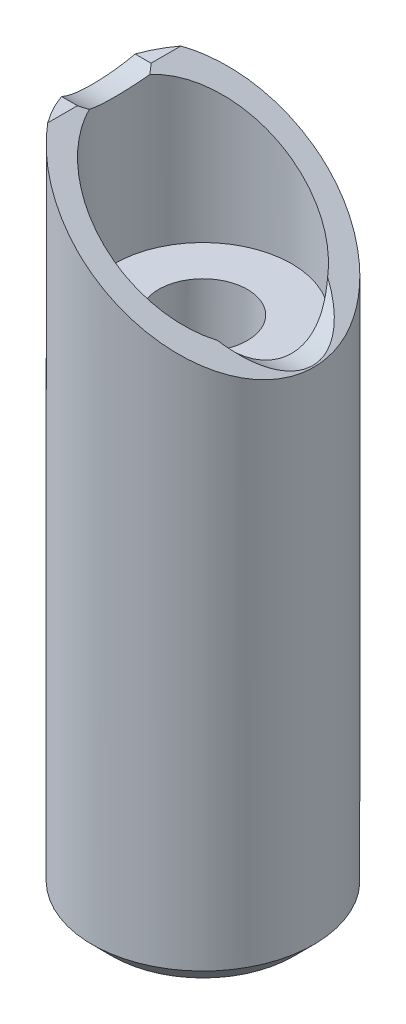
ISO-10303-21;
HEADER;
FILE_DESCRIPTION(('STEP AP214'),'2;1');
FILE_NAME('part.step','',(''),(''),'','','');
FILE_SCHEMA(('AUTOMOTIVE_DESIGN { 1 0 10303 214 1 1 1 1 }'));
ENDSEC;
DATA;
#1=APPLICATION_CONTEXT('core data for automotive mechanical design processes');
#2=APPLICATION_PROTOCOL_DEFINITION('international standard','automotive_design',2000,#1);
#3=PRODUCT_CONTEXT('',#1,'mechanical');
#4=PRODUCT('Part','Part','',(#3));
#5=PRODUCT_RELATED_PRODUCT_CATEGORY('part','',(#4));
#6=PRODUCT_DEFINITION_FORMATION('','',#4);
#7=PRODUCT_DEFINITION_CONTEXT('part definition',#1,'design');
#8=PRODUCT_DEFINITION('design','',#6,#7);
#9=PRODUCT_DEFINITION_SHAPE('','',#8);
#10=(LENGTH_UNIT() NAMED_UNIT(*) SI_UNIT(.MILLI.,.METRE.));
#11=(NAMED_UNIT(*) PLANE_ANGLE_UNIT() SI_UNIT($,.RADIAN.));
#12=(NAMED_UNIT(*) SI_UNIT($,.STERADIAN.) SOLID_ANGLE_UNIT());
#13=UNCERTAINTY_MEASURE_WITH_UNIT(LENGTH_MEASURE(1.E-05),#10,'distance_accuracy_value','');
#14=(GEOMETRIC_REPRESENTATION_CONTEXT(3) GLOBAL_UNCERTAINTY_ASSIGNED_CONTEXT((#13)) GLOBAL_UNIT_ASSIGNED_CONTEXT((#10,
#11,#12)) REPRESENTATION_CONTEXT('',''));
#15=CARTESIAN_POINT('',(0.,0.,0.));
#16=DIRECTION('',(0.,0.,1.));
#17=DIRECTION('',(1.,0.,0.));
#18=AXIS2_PLACEMENT_3D('',#15,#16,#17);
#19=CARTESIAN_POINT('',(-4.7169905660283,30.,-1.6583123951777));
#20=DIRECTION('',(0.,1.,0.));
#21=DIRECTION('',(1.,0.,0.));
#22=AXIS2_PLACEMENT_3D('',#19,#20,#21);
#23=PLANE('',#22);
#24=CARTESIAN_POINT('',(0.,30.,0.));
#25=DIRECTION('',(0.,1.,0.));
#26=DIRECTION('',(-0.8,0.,-0.6));
#27=AXIS2_PLACEMENT_3D('',#24,#25,#26);
#28=CIRCLE('',#27,5.);
#29=CARTESIAN_POINT('',(-4.7169905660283,30.,-1.6583123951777));
#30=VERTEX_POINT('',#29);
#31=CARTESIAN_POINT('',(-4.,30.,-3.));
#32=VERTEX_POINT('',#31);
#33=EDGE_CURVE('E81',#30,#32,#28,.F.);
#34=ORIENTED_EDGE('',*,*,#33,.F.);
#35=DIRECTION('',(1.,0.,-2.56971855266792E-10));
#36=VECTOR('',#35,1.);
#37=CARTESIAN_POINT('',(-4.7169905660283,30.,-1.6583123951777));
#38=LINE('',#37,#36);
#39=CARTESIAN_POINT('',(-4.00000000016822,30.,-1.65831239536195));
#40=VERTEX_POINT('',#39);
#41=EDGE_CURVE('E94',#30,#40,#38,.T.);
#42=ORIENTED_EDGE('',*,*,#41,.T.);
#43=DIRECTION('',(1.25376839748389E-10,0.,-1.));
#44=VECTOR('',#43,1.);
#45=CARTESIAN_POINT('',(-4.00000000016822,30.,-1.65831239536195));
#46=LINE('',#45,#44);
#47=EDGE_CURVE('E96',#40,#32,#46,.T.);
#48=ORIENTED_EDGE('',*,*,#47,.T.);
#49=EDGE_LOOP('',(#34,#42,#48));
#50=FACE_BOUND('',#49,.T.);
#51=ADVANCED_FACE('F14',(#50),#23,.T.);
#52=CARTESIAN_POINT('',(-4.7169905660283,30.,3.));
#53=DIRECTION('',(0.,1.,0.));
#54=DIRECTION('',(1.,0.,0.));
#55=AXIS2_PLACEMENT_3D('',#52,#53,#54);
#56=PLANE('',#55);
#57=DIRECTION('',(-1.13833127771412E-10,0.,-1.));
#58=VECTOR('',#57,1.);
#59=CARTESIAN_POINT('',(-4.00000000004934,30.,2.99999999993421));
#60=LINE('',#59,#58);
#61=CARTESIAN_POINT('',(-4.00000000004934,30.,2.99999999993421));
#62=VERTEX_POINT('',#61);
#63=CARTESIAN_POINT('',(-4.00000000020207,30.,1.65831239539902));
#64=VERTEX_POINT('',#63);
#65=EDGE_CURVE('E104',#62,#64,#60,.T.);
#66=ORIENTED_EDGE('',*,*,#65,.T.);
#67=DIRECTION('',(-1.,0.,-3.08683534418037E-10));
#68=VECTOR('',#67,1.);
#69=CARTESIAN_POINT('',(-4.00000000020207,30.,1.65831239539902));
#70=LINE('',#69,#68);
#71=CARTESIAN_POINT('',(-4.7169905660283,30.,1.6583123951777));
#72=VERTEX_POINT('',#71);
#73=EDGE_CURVE('E115',#64,#72,#70,.T.);
#74=ORIENTED_EDGE('',*,*,#73,.T.);
#75=CARTESIAN_POINT('',(0.,30.,0.));
#76=DIRECTION('',(0.,1.,0.));
#77=DIRECTION('',(-0.943398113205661,0.,0.33166247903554));
#78=AXIS2_PLACEMENT_3D('',#75,#76,#77);
#79=CIRCLE('',#78,5.);
#80=EDGE_CURVE('E83',#62,#72,#79,.F.);
#81=ORIENTED_EDGE('',*,*,#80,.F.);
#82=EDGE_LOOP('',(#66,#74,#81));
#83=FACE_BOUND('',#82,.T.);
#84=ADVANCED_FACE('F345',(#83),#56,.T.);
#85=CARTESIAN_POINT('',(-4.07999980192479,0.,-4.08));
#86=DIRECTION('',(0.,-1.,0.));
#87=DIRECTION('',(1.,0.,0.));
#88=AXIS2_PLACEMENT_3D('',#85,#86,#87);
#89=PLANE('',#88);
#90=CARTESIAN_POINT('',(0.,0.,0.));
#91=DIRECTION('',(0.,-1.,0.));
#92=DIRECTION('',(-1.42331231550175E-07,0.,1.));
#93=AXIS2_PLACEMENT_3D('',#90,#91,#92);
#94=CIRCLE('',#93,4.08);
#95=CARTESIAN_POINT('',(-5.80711424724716E-07,0.,4.08));
#96=VERTEX_POINT('',#95);
#97=EDGE_CURVE('E122',#96,#96,#94,.T.);
#98=ORIENTED_EDGE('',*,*,#97,.T.);
#99=EDGE_LOOP('',(#98));
#100=FACE_BOUND('',#99,.T.);
#101=CARTESIAN_POINT('',(0.,0.,0.));
#102=DIRECTION('',(0.,1.,0.));
#103=DIRECTION('',(0.,0.,-1.));
#104=AXIS2_PLACEMENT_3D('',#101,#102,#103);
#105=CIRCLE('',#104,3.);
#106=CARTESIAN_POINT('',(0.,0.,-3.));
#107=VERTEX_POINT('',#106);
#108=EDGE_CURVE('E127',#107,#107,#105,.F.);
#109=ORIENTED_EDGE('',*,*,#108,.F.);
#110=EDGE_LOOP('',(#109));
#111=FACE_BOUND('',#110,.T.);
#112=ADVANCED_FACE('F147',(#100,#111),#89,.T.);
#113=CARTESIAN_POINT('',(4.9999999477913,23.4611172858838,-5.));
#114=DIRECTION('',(0.587785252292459,0.809016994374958,0.));
#115=DIRECTION('',(-0.809016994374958,0.587785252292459,0.));
#116=AXIS2_PLACEMENT_3D('',#113,#114,#115);
#117=PLANE('',#116);
#118=CARTESIAN_POINT('',(-3.76128485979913,29.8265632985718,-1.36115252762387));
#119=CARTESIAN_POINT('',(-3.7702929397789,29.8331080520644,-1.37400703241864));
#120=CARTESIAN_POINT('',(-3.77939272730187,29.8397194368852,-1.3867631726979));
#121=CARTESIAN_POINT('',(-3.79783702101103,29.8531200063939,-1.41217356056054));
#122=CARTESIAN_POINT('',(-3.80718284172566,29.8599101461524,-1.42482635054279));
#123=CARTESIAN_POINT('',(-3.82611727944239,29.8736668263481,-1.45002816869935));
#124=CARTESIAN_POINT('',(-3.83570719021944,29.8806343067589,-1.4625757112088));
#125=CARTESIAN_POINT('',(-3.85512795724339,29.894744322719,-1.48756522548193));
#126=CARTESIAN_POINT('',(-3.8649600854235,29.9018877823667,-1.50000568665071));
#127=CARTESIAN_POINT('',(-3.88486341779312,29.916348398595,-1.524779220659));
#128=CARTESIAN_POINT('',(-3.89493587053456,29.9236664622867,-1.53711076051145));
#129=CARTESIAN_POINT('',(-3.91531799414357,29.9384749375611,-1.56166464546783));
#130=CARTESIAN_POINT('',(-3.92562888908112,29.9459662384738,-1.57388543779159));
#131=CARTESIAN_POINT('',(-3.94648601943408,29.9611198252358,-1.59821601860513));
#132=CARTESIAN_POINT('',(-3.95703345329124,29.9687829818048,-1.61032423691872));
#133=CARTESIAN_POINT('',(-3.97836185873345,29.9842789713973,-1.6344278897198));
#134=CARTESIAN_POINT('',(-3.98914400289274,29.9921126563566,-1.64642173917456));
#135=CARTESIAN_POINT('',(-4.00000000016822,30.0000000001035,-1.6583123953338));
#136=B_SPLINE_CURVE_WITH_KNOTS('',3,(#118,#119,#120,#121,#122,#123,#124,#125,#126,#127,#128,
#129,#130,#131,#132,#133,#134,#135),.UNSPECIFIED.,.F.,.F.,(4,2,2,2,2,2,2,2,4),(0.,
0.0510183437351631,0.102415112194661,0.154196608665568,0.206368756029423,0.258937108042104,
0.311906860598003,0.365282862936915,0.419069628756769),.UNSPECIFIED.);
#137=CARTESIAN_POINT('',(-3.76128485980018,29.8265632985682,-1.36115252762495));
#138=VERTEX_POINT('',#137);
#139=EDGE_CURVE('E101',#138,#40,#136,.T.);
#140=ORIENTED_EDGE('',*,*,#139,.F.);
#141=CARTESIAN_POINT('',(-3.76128485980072,29.8265632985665,-1.36115252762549));
#142=CARTESIAN_POINT('',(-3.4736956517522,29.6176175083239,-2.1558503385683));
#143=CARTESIAN_POINT('',(-2.95301227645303,29.2393188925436,-2.81556220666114));
#144=CARTESIAN_POINT('',(-1.63580229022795,28.2823098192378,-3.73763703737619));
#145=CARTESIAN_POINT('',(-0.839275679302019,27.7035993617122,-3.99999999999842));
#146=CARTESIAN_POINT('',(0.,27.0938298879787,-4.));
#147=B_SPLINE_CURVE_WITH_KNOTS('',3,(#141,#142,#143,#144,#145,#146),.UNSPECIFIED.,.F.,.F.,(4,2,
4),(0.,0.5,1.),.UNSPECIFIED.);
#148=CARTESIAN_POINT('',(0.,27.0938298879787,-4.));
#149=VERTEX_POINT('',#148);
#150=EDGE_CURVE('E208',#138,#149,#147,.T.);
#151=ORIENTED_EDGE('',*,*,#150,.T.);
#152=CARTESIAN_POINT('',(0.,27.0938298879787,-4.));
#153=CARTESIAN_POINT('',(0.611112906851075,26.6498303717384,-3.99999999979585));
#154=CARTESIAN_POINT('',(1.2055984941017,26.2179113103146,-3.86028777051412));
#155=CARTESIAN_POINT('',(2.27875029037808,25.4382208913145,-3.34105504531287));
#156=CARTESIAN_POINT('',(2.75741649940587,25.0904495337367,-2.9615345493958));
#157=CARTESIAN_POINT('',(3.13689064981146,24.8147454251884,-2.48191801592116));
#158=B_SPLINE_CURVE_WITH_KNOTS('',3,(#152,#153,#154,#155,#156,#157),.UNSPECIFIED.,.F.,.F.,(4,2,
4),(0.,0.5,1.),.UNSPECIFIED.);
#159=CARTESIAN_POINT('',(3.1368906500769,24.8147454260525,-2.48191801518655));
#160=VERTEX_POINT('',#159);
#161=EDGE_CURVE('E203',#149,#160,#158,.T.);
#162=ORIENTED_EDGE('',*,*,#161,.T.);
#163=CARTESIAN_POINT('',(3.13689064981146,24.8147454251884,-2.48191801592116));
#164=CARTESIAN_POINT('',(3.85437040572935,24.2934658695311,-2.1279624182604));
#165=CARTESIAN_POINT('',(4.38830500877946,23.9055396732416,-1.62494759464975));
#166=CARTESIAN_POINT('',(4.83183253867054,23.5832980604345,-0.767359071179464));
#167=CARTESIAN_POINT('',(4.92011265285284,23.5191588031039,-0.464318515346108));
#168=CARTESIAN_POINT('',(4.96387198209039,23.4873657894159,0.156030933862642));
#169=CARTESIAN_POINT('',(4.91935119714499,23.5197120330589,0.473339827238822));
#170=CARTESIAN_POINT('',(4.53756001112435,23.7970995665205,1.49266463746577));
#171=CARTESIAN_POINT('',(3.93685902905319,24.2335343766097,2.08726815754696));
#172=CARTESIAN_POINT('',(3.13689060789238,24.8147454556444,2.48191803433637));
#173=B_SPLINE_CURVE_WITH_KNOTS('',3,(#163,#164,#165,#166,#167,#168,#169,#170,#171,#172),
.UNSPECIFIED.,.F.,.F.,(4,2,2,2,4),(0.,0.320403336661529,0.480605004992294,0.64080667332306,1.),.UNSPECIFIED.);
#174=CARTESIAN_POINT('',(3.13689060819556,24.8147454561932,2.4819180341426));
#175=VERTEX_POINT('',#174);
#176=EDGE_CURVE('E198',#160,#175,#173,.T.);
#177=ORIENTED_EDGE('',*,*,#176,.T.);
#178=CARTESIAN_POINT('',(3.13689060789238,24.8147454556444,2.48191803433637));
#179=CARTESIAN_POINT('',(2.75741643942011,25.0904495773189,2.96153459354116));
#180=CARTESIAN_POINT('',(2.27875022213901,25.4382209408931,3.34105508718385));
#181=CARTESIAN_POINT('',(1.20559843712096,26.2179113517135,3.86028779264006));
#182=CARTESIAN_POINT('',(0.611112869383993,26.6498303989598,4.00000000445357));
#183=CARTESIAN_POINT('',(0.,27.0938298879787,4.));
#184=B_SPLINE_CURVE_WITH_KNOTS('',3,(#178,#179,#180,#181,#182,#183),.UNSPECIFIED.,.F.,.F.,(4,2,
4),(0.,0.5,1.),.UNSPECIFIED.);
#185=CARTESIAN_POINT('',(0.,27.0938298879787,4.));
#186=VERTEX_POINT('',#185);
#187=EDGE_CURVE('E200',#175,#186,#184,.T.);
#188=ORIENTED_EDGE('',*,*,#187,.T.);
#189=CARTESIAN_POINT('',(0.,27.0938298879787,4.));
#190=CARTESIAN_POINT('',(-0.839275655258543,27.7035993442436,4.));
#191=CARTESIAN_POINT('',(-1.63580226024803,28.2823097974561,3.73763705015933));
#192=CARTESIAN_POINT('',(-2.95301225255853,29.2393188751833,2.81556223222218));
#193=CARTESIAN_POINT('',(-3.47369563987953,29.6176174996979,2.15585036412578));
#194=CARTESIAN_POINT('',(-3.76128485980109,29.8265632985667,1.36115252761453));
#195=B_SPLINE_CURVE_WITH_KNOTS('',3,(#189,#190,#191,#192,#193,#194),.UNSPECIFIED.,.F.,.F.,(4,2,
4),(0.,0.5,1.),.UNSPECIFIED.);
#196=CARTESIAN_POINT('',(-3.76128485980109,29.8265632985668,1.36115252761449));
#197=VERTEX_POINT('',#196);
#198=EDGE_CURVE('E207',#186,#197,#195,.T.);
#199=ORIENTED_EDGE('',*,*,#198,.T.);
#200=CARTESIAN_POINT('',(-4.00000000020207,30.0000000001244,1.65831239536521));
#201=CARTESIAN_POINT('',(-3.98914400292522,29.9921126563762,1.64642173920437));
#202=CARTESIAN_POINT('',(-3.97836185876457,29.9842789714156,1.634427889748));
#203=CARTESIAN_POINT('',(-3.95703345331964,29.9687829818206,1.61032423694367));
#204=CARTESIAN_POINT('',(-3.94648601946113,29.9611198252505,1.59821601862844));
#205=CARTESIAN_POINT('',(-3.92562888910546,29.9459662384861,1.5738854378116));
#206=CARTESIAN_POINT('',(-3.91531799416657,29.9384749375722,1.56166464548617));
#207=CARTESIAN_POINT('',(-3.89493587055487,29.9236664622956,1.53711076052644));
#208=CARTESIAN_POINT('',(-3.8848634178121,29.9163483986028,1.5247792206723));
#209=CARTESIAN_POINT('',(-3.86496008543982,29.9018877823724,1.5000056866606));
#210=CARTESIAN_POINT('',(-3.85512795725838,29.8947443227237,1.4875652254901));
#211=CARTESIAN_POINT('',(-3.83570719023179,29.8806343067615,1.46257571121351));
#212=CARTESIAN_POINT('',(-3.82611727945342,29.8736668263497,1.45002816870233));
#213=CARTESIAN_POINT('',(-3.80718284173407,29.8599101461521,1.42482635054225));
#214=CARTESIAN_POINT('',(-3.79783702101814,29.8531200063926,1.41217356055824));
#215=CARTESIAN_POINT('',(-3.77939272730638,29.8397194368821,1.38676317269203));
#216=CARTESIAN_POINT('',(-3.77029293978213,29.8331080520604,1.37400703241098));
#217=CARTESIAN_POINT('',(-3.76128485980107,29.826563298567,1.3611525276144));
#218=B_SPLINE_CURVE_WITH_KNOTS('',3,(#200,#201,#202,#203,#204,#205,#206,#207,#208,#209,#210,
#211,#212,#213,#214,#215,#216,#217),.UNSPECIFIED.,.F.,.F.,(4,2,2,2,2,2,2,2,4),(0.,
0.0537867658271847,0.1071627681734,0.160132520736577,0.212700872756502,0.264873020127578,
0.316654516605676,0.368051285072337,0.419069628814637),.UNSPECIFIED.);
#219=EDGE_CURVE('E295',#64,#197,#218,.T.);
#220=ORIENTED_EDGE('',*,*,#219,.F.);
#221=ORIENTED_EDGE('',*,*,#65,.F.);
#222=CARTESIAN_POINT('',(-4.00000000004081,30.0000000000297,2.99999999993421));
#223=CARTESIAN_POINT('',(-3.52727374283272,29.6565442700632,3.63030166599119));
#224=CARTESIAN_POINT('',(-2.92024288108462,29.2155105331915,4.13030165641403));
#225=CARTESIAN_POINT('',(-1.54957516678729,28.2196621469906,4.81515081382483));
#226=CARTESIAN_POINT('',(-0.785938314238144,27.6648474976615,4.99999998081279));
#227=CARTESIAN_POINT('',(-7.54279347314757E-08,27.0938299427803,5.00000000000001));
#228=B_SPLINE_CURVE_WITH_KNOTS('',3,(#222,#223,#224,#225,#226,#227),.UNSPECIFIED.,.F.,.F.,(4,2,
4),(0.,0.5,1.),.UNSPECIFIED.);
#229=CARTESIAN_POINT('',(-6.5065641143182E-08,27.0938299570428,5.));
#230=VERTEX_POINT('',#229);
#231=EDGE_CURVE('E39',#62,#230,#228,.T.);
#232=ORIENTED_EDGE('',*,*,#231,.T.);
#233=CARTESIAN_POINT('',(-7.54279347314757E-08,27.0938299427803,5.00000000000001));
#234=CARTESIAN_POINT('',(1.37466894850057,26.0950744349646,5.00000000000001));
#235=CARTESIAN_POINT('',(2.62466895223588,25.1868962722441,4.44348361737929));
#236=CARTESIAN_POINT('',(3.98416807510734,24.199162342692,3.08859633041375));
#237=CARTESIAN_POINT('',(4.35141763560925,23.9323399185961,2.55028178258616));
#238=CARTESIAN_POINT('',(4.85933357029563,23.5633173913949,1.35272542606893));
#239=CARTESIAN_POINT('',(4.99999994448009,23.4611172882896,0.693483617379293));
#240=CARTESIAN_POINT('',(4.9999999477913,23.4611172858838,-0.693483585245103));
#241=CARTESIAN_POINT('',(4.85933358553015,23.5633173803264,-1.35272537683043));
#242=CARTESIAN_POINT('',(4.09745972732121,24.1168511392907,-3.14905988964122));
#243=CARTESIAN_POINT('',(3.13637745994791,24.8151182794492,-4.10476174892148));
#244=CARTESIAN_POINT('',(1.34350179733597,26.1177186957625,-4.86087089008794));
#245=CARTESIAN_POINT('',(0.687334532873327,26.5944521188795,-4.99999999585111));
#246=CARTESIAN_POINT('',(-1.73972988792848E-09,27.0938298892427,-5.));
#247=B_SPLINE_CURVE_WITH_KNOTS('',3,(#233,#234,#235,#236,#237,#238,#239,#240,#241,#242,#243,
#244,#245,#246),.UNSPECIFIED.,.F.,.F.,(4,2,2,2,2,2,4),(0.,0.250000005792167,0.375000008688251,
0.500000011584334,0.62500000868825,0.875000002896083,1.),.UNSPECIFIED.);
#248=CARTESIAN_POINT('',(-4.33030023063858E-09,27.093829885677,-5.));
#249=VERTEX_POINT('',#248);
#250=EDGE_CURVE('E33',#230,#249,#247,.T.);
#251=ORIENTED_EDGE('',*,*,#250,.T.);
#252=CARTESIAN_POINT('',(-1.73972988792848E-09,27.0938298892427,-5.));
#253=CARTESIAN_POINT('',(-0.785938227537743,27.66484743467,-4.9999999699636));
#254=CARTESIAN_POINT('',(-1.54957507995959,28.2196620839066,-4.81515080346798));
#255=CARTESIAN_POINT('',(-2.92024281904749,29.2155104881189,-4.13030165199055));
#256=CARTESIAN_POINT('',(-3.52727370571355,29.6565442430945,-3.63030166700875));
#257=CARTESIAN_POINT('',(-4.,30.,-3.));
#258=B_SPLINE_CURVE_WITH_KNOTS('',3,(#252,#253,#254,#255,#256,#257),.UNSPECIFIED.,.F.,.F.,(4,2,
4),(0.,0.5,1.),.UNSPECIFIED.);
#259=EDGE_CURVE('E320',#249,#32,#258,.T.);
#260=ORIENTED_EDGE('',*,*,#259,.T.);
#261=ORIENTED_EDGE('',*,*,#47,.F.);
#262=EDGE_LOOP('',(#140,#151,#162,#177,#188,#199,#220,#221,#232,#251,#260,#261));
#263=FACE_BOUND('',#262,.T.);
#264=ADVANCED_FACE('F136',(#263),#117,.T.);
#265=CARTESIAN_POINT('',(-4.,23.,-4.));
#266=DIRECTION('',(0.,1.,0.));
#267=DIRECTION('',(0.,0.,1.));
#268=AXIS2_PLACEMENT_3D('',#265,#266,#267);
#269=PLANE('',#268);
#270=CARTESIAN_POINT('',(0.,23.,0.));
#271=DIRECTION('',(0.,1.,0.));
#272=DIRECTION('',(0.,0.,-1.));
#273=AXIS2_PLACEMENT_3D('',#270,#271,#272);
#274=CIRCLE('',#273,4.);
#275=CARTESIAN_POINT('',(0.,23.,-4.));
#276=VERTEX_POINT('',#275);
#277=EDGE_CURVE('E321',#276,#276,#274,.F.);
#278=ORIENTED_EDGE('',*,*,#277,.F.);
#279=EDGE_LOOP('',(#278));
#280=FACE_BOUND('',#279,.T.);
#281=CARTESIAN_POINT('',(0.,23.,0.));
#282=DIRECTION('',(0.,-1.,0.));
#283=DIRECTION('',(0.,0.,1.));
#284=AXIS2_PLACEMENT_3D('',#281,#282,#283);
#285=CIRCLE('',#284,2.);
#286=CARTESIAN_POINT('',(0.,23.,2.));
#287=VERTEX_POINT('',#286);
#288=EDGE_CURVE('E323',#287,#287,#285,.T.);
#289=ORIENTED_EDGE('',*,*,#288,.T.);
#290=EDGE_LOOP('',(#289));
#291=FACE_BOUND('',#290,.T.);
#292=ADVANCED_FACE('F146',(#280,#291),#269,.T.);
#293=CARTESIAN_POINT('',(-3.,20.,3.));
#294=DIRECTION('',(0.,-1.,0.));
#295=DIRECTION('',(0.,0.,-1.));
#296=AXIS2_PLACEMENT_3D('',#293,#294,#295);
#297=PLANE('',#296);
#298=CARTESIAN_POINT('',(0.,20.,0.));
#299=DIRECTION('',(0.,-1.,0.));
#300=DIRECTION('',(0.,0.,1.));
#301=AXIS2_PLACEMENT_3D('',#298,#299,#300);
#302=CIRCLE('',#301,3.);
#303=CARTESIAN_POINT('',(0.,20.,3.));
#304=VERTEX_POINT('',#303);
#305=EDGE_CURVE('E326',#304,#304,#302,.T.);
#306=ORIENTED_EDGE('',*,*,#305,.T.);
#307=EDGE_LOOP('',(#306));
#308=FACE_BOUND('',#307,.T.);
#309=CARTESIAN_POINT('',(0.,20.,0.));
#310=DIRECTION('',(0.,1.,0.));
#311=DIRECTION('',(0.,0.,-1.));
#312=AXIS2_PLACEMENT_3D('',#309,#310,#311);
#313=CIRCLE('',#312,2.);
#314=CARTESIAN_POINT('',(0.,20.,-2.));
#315=VERTEX_POINT('',#314);
#316=EDGE_CURVE('E260',#315,#315,#313,.F.);
#317=ORIENTED_EDGE('',*,*,#316,.F.);
#318=EDGE_LOOP('',(#317));
#319=FACE_BOUND('',#318,.T.);
#320=ADVANCED_FACE('F274',(#308,#319),#297,.T.);
#321=CARTESIAN_POINT('',(6.,26.5,0.));
#322=DIRECTION('',(-1.,0.,0.));
#323=DIRECTION('',(0.,-0.561751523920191,-0.827306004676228));
#324=AXIS2_PLACEMENT_3D('',#321,#322,#323);
#325=CYLINDRICAL_SURFACE('',#324,3.);
#326=CARTESIAN_POINT('',(3.13689062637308,24.8147454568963,2.48191804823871));
#327=CARTESIAN_POINT('',(3.14752027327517,24.7949600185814,2.46848337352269));
#328=CARTESIAN_POINT('',(3.15818868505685,24.7753493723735,2.45482211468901));
#329=CARTESIAN_POINT('',(3.1796091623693,24.7364290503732,2.42701344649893));
#330=CARTESIAN_POINT('',(3.19036137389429,24.7171202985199,2.41286485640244));
#331=CARTESIAN_POINT('',(3.21192275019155,24.6788178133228,2.3840881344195));
#332=CARTESIAN_POINT('',(3.22273198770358,24.6598248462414,2.36945903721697));
#333=CARTESIAN_POINT('',(3.2443811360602,24.6221680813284,2.33972856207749));
#334=CARTESIAN_POINT('',(3.25522106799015,24.6035048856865,2.32462643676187));
#335=CARTESIAN_POINT('',(3.27690554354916,24.5665217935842,2.2939579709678));
#336=CARTESIAN_POINT('',(3.28775007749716,24.5482023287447,2.27839110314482));
#337=CARTESIAN_POINT('',(3.30941804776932,24.5119208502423,2.24680201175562));
#338=CARTESIAN_POINT('',(3.3202414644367,24.4939590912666,2.23077948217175));
#339=CARTESIAN_POINT('',(3.34184186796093,24.4584071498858,2.19828878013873));
#340=CARTESIAN_POINT('',(3.35261884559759,24.4408170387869,2.18182052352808));
#341=CARTESIAN_POINT('',(3.37410154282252,24.406022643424,2.14844884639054));
#342=CARTESIAN_POINT('',(3.38480728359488,24.3888182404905,2.13154556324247));
#343=CARTESIAN_POINT('',(3.40612301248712,24.3548090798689,2.0973154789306));
#344=CARTESIAN_POINT('',(3.41673307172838,24.3380040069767,2.07998903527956));
#345=CARTESIAN_POINT('',(3.43783419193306,24.3048089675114,2.04492400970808));
#346=CARTESIAN_POINT('',(3.44832539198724,24.2884184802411,2.027186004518));
#347=CARTESIAN_POINT('',(3.46916145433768,24.2560654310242,1.99131816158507));
#348=CARTESIAN_POINT('',(3.4795065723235,24.2401020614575,1.9731892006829));
#349=CARTESIAN_POINT('',(3.50002304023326,24.2086033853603,1.93656352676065));
#350=CARTESIAN_POINT('',(3.5101947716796,24.1930670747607,1.91806789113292));
#351=CARTESIAN_POINT('',(3.53035530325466,24.1624339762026,1.88070225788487));
#352=CARTESIAN_POINT('',(3.54034447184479,24.1473362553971,1.86183322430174));
#353=CARTESIAN_POINT('',(3.56012818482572,24.1175854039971,1.82371803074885));
#354=CARTESIAN_POINT('',(3.569923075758,24.1029314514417,1.80447269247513));
#355=CARTESIAN_POINT('',(3.58930677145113,24.0740748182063,1.76560125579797));
#356=CARTESIAN_POINT('',(3.59889588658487,24.0598714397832,1.7459758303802));
#357=CARTESIAN_POINT('',(3.61785596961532,24.0319220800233,1.70634116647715));
#358=CARTESIAN_POINT('',(3.62722719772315,24.0181755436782,1.68633244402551));
#359=CARTESIAN_POINT('',(3.64573915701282,23.9911465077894,1.64592811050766));
#360=CARTESIAN_POINT('',(3.65488008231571,23.9778636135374,1.62553285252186));
#361=CARTESIAN_POINT('',(3.67291836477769,23.9517668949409,1.58435342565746));
#362=CARTESIAN_POINT('',(3.68181583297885,23.9389528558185,1.56356944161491));
#363=CARTESIAN_POINT('',(3.69935610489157,23.9138028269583,1.52160491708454));
#364=CARTESIAN_POINT('',(3.70799888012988,23.9014668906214,1.50042433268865));
#365=CARTESIAN_POINT('',(3.72507091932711,23.8771773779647,1.45752654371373));
#366=CARTESIAN_POINT('',(3.73349811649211,23.8652273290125,1.43580651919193));
#367=CARTESIAN_POINT('',(3.75015426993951,23.8416832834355,1.3917272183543));
#368=CARTESIAN_POINT('',(3.75837965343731,23.830095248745,1.36936340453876));
#369=CARTESIAN_POINT('',(3.77461315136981,23.8073033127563,1.32396529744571));
#370=CARTESIAN_POINT('',(3.78261711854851,23.7961062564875,1.30092608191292));
#371=CARTESIAN_POINT('',(3.79838557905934,23.7741223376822,1.25414695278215));
#372=CARTESIAN_POINT('',(3.80614525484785,23.7633432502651,1.23040175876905));
#373=CARTESIAN_POINT('',(3.82140003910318,23.7422217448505,1.18218045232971));
#374=CARTESIAN_POINT('',(3.82888956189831,23.7318881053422,1.1576987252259));
#375=CARTESIAN_POINT('',(3.84357581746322,23.7116839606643,1.10797450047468));
#376=CARTESIAN_POINT('',(3.8507660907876,23.7018232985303,1.08272609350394));
#377=CARTESIAN_POINT('',(3.8648223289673,23.682590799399,1.03143935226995));
#378=CARTESIAN_POINT('',(3.8716808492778,23.6732299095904,1.00539486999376));
#379=CARTESIAN_POINT('',(3.88503882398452,23.6550254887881,0.952486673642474));
#380=CARTESIAN_POINT('',(3.89152973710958,23.6461941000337,0.92561662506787));
#381=CARTESIAN_POINT('',(3.90410092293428,23.629083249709,0.871086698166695));
#382=CARTESIAN_POINT('',(3.91017249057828,23.6208155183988,0.843421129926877));
#383=CARTESIAN_POINT('',(3.92184596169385,23.6049250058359,0.787372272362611));
#384=CARTESIAN_POINT('',(3.92744012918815,23.5973128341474,0.758984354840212));
#385=CARTESIAN_POINT('',(3.93815312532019,23.5827808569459,0.701304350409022));
#386=CARTESIAN_POINT('',(3.9432598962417,23.5758783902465,0.672005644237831));
#387=CARTESIAN_POINT('',(3.95297684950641,23.5627950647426,0.612301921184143));
#388=CARTESIAN_POINT('',(3.95756958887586,23.5566391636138,0.581888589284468));
#389=CARTESIAN_POINT('',(3.96621671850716,23.5450819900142,0.519751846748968));
#390=CARTESIAN_POINT('',(3.97024748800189,23.5397135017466,0.488019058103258));
#391=CARTESIAN_POINT('',(3.97766342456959,23.5298165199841,0.423415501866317));
#392=CARTESIAN_POINT('',(3.98102707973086,23.5253161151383,0.390537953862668));
#393=CARTESIAN_POINT('',(3.98693866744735,23.5174134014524,0.324669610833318));
#394=CARTESIAN_POINT('',(3.9894888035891,23.5140081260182,0.291679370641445));
#395=CARTESIAN_POINT('',(3.99376463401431,23.5082982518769,0.225683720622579));
#396=CARTESIAN_POINT('',(3.99549357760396,23.5059893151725,0.192678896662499));
#397=CARTESIAN_POINT('',(3.99812957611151,23.5024687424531,0.126678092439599));
#398=CARTESIAN_POINT('',(3.99903909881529,23.5012538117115,0.0936823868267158));
#399=CARTESIAN_POINT('',(4.00003962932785,23.4999158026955,0.0277239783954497));
#400=CARTESIAN_POINT('',(4.00013230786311,23.4997904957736,-0.00523865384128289));
#401=CARTESIAN_POINT('',(3.99950339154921,23.5006267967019,-0.0711071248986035));
#402=CARTESIAN_POINT('',(3.99878266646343,23.5015872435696,-0.104012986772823));
#403=CARTESIAN_POINT('',(3.99653201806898,23.5045900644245,-0.169744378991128));
#404=CARTESIAN_POINT('',(3.99500217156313,23.5066323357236,-0.202569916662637));
#405=CARTESIAN_POINT('',(3.99113915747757,23.5117935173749,-0.268117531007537));
#406=CARTESIAN_POINT('',(3.9888052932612,23.5149133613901,-0.300839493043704));
#407=CARTESIAN_POINT('',(3.98334095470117,23.5222257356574,-0.366156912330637));
#408=CARTESIAN_POINT('',(3.98020904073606,23.5264202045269,-0.398752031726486));
#409=CARTESIAN_POINT('',(3.97315591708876,23.5358729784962,-0.463794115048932));
#410=CARTESIAN_POINT('',(3.96923256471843,23.5411341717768,-0.496240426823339));
#411=CARTESIAN_POINT('',(3.9606052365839,23.5527300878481,-0.56095986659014));
#412=CARTESIAN_POINT('',(3.95589846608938,23.5590686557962,-0.593231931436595));
#413=CARTESIAN_POINT('',(3.94582272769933,23.5726100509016,-0.656889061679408));
#414=CARTESIAN_POINT('',(3.94046669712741,23.5797959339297,-0.688279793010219));
#415=CARTESIAN_POINT('',(3.92926268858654,23.5948203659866,-0.749552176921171));
#416=CARTESIAN_POINT('',(3.92344014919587,23.6026250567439,-0.77944677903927));
#417=CARTESIAN_POINT('',(3.91136939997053,23.6188701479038,-0.837884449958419));
#418=CARTESIAN_POINT('',(3.90514131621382,23.6272814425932,-0.866439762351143));
#419=CARTESIAN_POINT('',(3.89230642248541,23.6447030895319,-0.922361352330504));
#420=CARTESIAN_POINT('',(3.8857151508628,23.6536899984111,-0.949738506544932));
#421=CARTESIAN_POINT('',(3.87218374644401,23.6722300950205,-1.00346530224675));
#422=CARTESIAN_POINT('',(3.86525522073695,23.6817653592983,-1.02982405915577));
#423=CARTESIAN_POINT('',(3.85106372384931,23.7013716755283,-1.08167355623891));
#424=CARTESIAN_POINT('',(3.84380901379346,23.7114299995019,-1.10717138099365));
#425=CARTESIAN_POINT('',(3.8289635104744,23.7320403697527,-1.15746145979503));
#426=CARTESIAN_POINT('',(3.82137815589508,23.7425845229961,-1.18225856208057));
#427=CARTESIAN_POINT('',(3.80584351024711,23.7641950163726,-1.23134655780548));
#428=CARTESIAN_POINT('',(3.79789625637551,23.7752584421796,-1.25563937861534));
#429=CARTESIAN_POINT('',(3.78163430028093,23.7979722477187,-1.30379738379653));
#430=CARTESIAN_POINT('',(3.77331990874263,23.8096221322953,-1.32766290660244));
#431=CARTESIAN_POINT('',(3.75634648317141,23.8334761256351,-1.3749513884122));
#432=CARTESIAN_POINT('',(3.74768787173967,23.8456795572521,-1.39837484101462));
#433=CARTESIAN_POINT('',(3.73005156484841,23.8706221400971,-1.44475950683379));
#434=CARTESIAN_POINT('',(3.72107439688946,23.8833604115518,-1.467721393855));
#435=CARTESIAN_POINT('',(3.7028269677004,23.9093503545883,-1.51316581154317));
#436=CARTESIAN_POINT('',(3.69355733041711,23.9226009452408,-1.5356492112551));
#437=CARTESIAN_POINT('',(3.67475192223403,23.9495942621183,-1.58012015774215));
#438=CARTESIAN_POINT('',(3.66521685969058,23.9633357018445,-1.60210878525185));
#439=CARTESIAN_POINT('',(3.64590826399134,23.9912890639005,-1.64557491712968));
#440=CARTESIAN_POINT('',(3.63613550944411,24.0054994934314,-1.66705372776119));
#441=CARTESIAN_POINT('',(3.6163799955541,24.0343696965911,-1.709485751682));
#442=CARTESIAN_POINT('',(3.60639806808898,24.0490277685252,-1.7304405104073));
#443=CARTESIAN_POINT('',(3.5862344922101,24.0787976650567,-1.77184971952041));
#444=CARTESIAN_POINT('',(3.57605330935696,24.0939084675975,-1.79230513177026));
#445=CARTESIAN_POINT('',(3.55547307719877,24.1246169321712,-1.83279230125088));
#446=CARTESIAN_POINT('',(3.54507371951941,24.1402153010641,-1.85282336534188));
#447=CARTESIAN_POINT('',(3.52407983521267,24.1718867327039,-1.89244939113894));
#448=CARTESIAN_POINT('',(3.51348508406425,24.187960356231,-1.91204378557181));
#449=CARTESIAN_POINT('',(3.49212480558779,24.220565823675,-1.95078290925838));
#450=CARTESIAN_POINT('',(3.48135915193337,24.2370980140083,-1.9699272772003));
#451=CARTESIAN_POINT('',(3.45968229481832,24.2706046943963,-2.0077534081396));
#452=CARTESIAN_POINT('',(3.44877104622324,24.2875793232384,-2.02643502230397));
#453=CARTESIAN_POINT('',(3.42682880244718,24.3219548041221,-2.06332373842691));
#454=CARTESIAN_POINT('',(3.41579782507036,24.3393555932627,-2.08153090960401));
#455=CARTESIAN_POINT('',(3.39364249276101,24.3745673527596,-2.11745974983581));
#456=CARTESIAN_POINT('',(3.38251819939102,24.3923780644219,-2.13518171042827));
#457=CARTESIAN_POINT('',(3.3602030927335,24.4283936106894,-2.17013007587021));
#458=CARTESIAN_POINT('',(3.34901236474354,24.446597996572,-2.18735699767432));
#459=CARTESIAN_POINT('',(3.32659167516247,24.4833848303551,-2.22130614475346));
#460=CARTESIAN_POINT('',(3.31536180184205,24.501966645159,-2.23802911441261));
#461=CARTESIAN_POINT('',(3.29289047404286,24.5394922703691,-2.27096210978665));
#462=CARTESIAN_POINT('',(3.28164908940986,24.5584352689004,-2.28717310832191));
#463=CARTESIAN_POINT('',(3.25918268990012,24.5966671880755,-2.3190747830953));
#464=CARTESIAN_POINT('',(3.24795770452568,24.6159551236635,-2.33476666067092));
#465=CARTESIAN_POINT('',(3.22555231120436,24.6548608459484,-2.36562354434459));
#466=CARTESIAN_POINT('',(3.2143718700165,24.674477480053,-2.38078997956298));
#467=CARTESIAN_POINT('',(3.19208389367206,24.7140244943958,-2.41059025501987));
#468=CARTESIAN_POINT('',(3.18097624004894,24.733953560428,-2.42522575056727));
#469=CARTESIAN_POINT('',(3.15886250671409,24.7741094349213,-2.45395908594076));
#470=CARTESIAN_POINT('',(3.14785619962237,24.7943347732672,-2.46805880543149));
#471=CARTESIAN_POINT('',(3.13689065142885,24.8147454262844,-2.48191801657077));
#472=B_SPLINE_CURVE_WITH_KNOTS('',3,(#326,#327,#328,#329,#330,#331,#332,#333,#334,#335,#336,
#337,#338,#339,#340,#341,#342,#343,#344,#345,#346,#347,#348,#349,#350,#351,#352,#353,#354,#355,
#356,#357,#358,#359,#360,#361,#362,#363,#364,#365,#366,#367,#368,#369,#370,#371,#372,#373,#374,
#375,#376,#377,#378,#379,#380,#381,#382,#383,#384,#385,#386,#387,#388,#389,#390,#391,#392,#393,
#394,#395,#396,#397,#398,#399,#400,#401,#402,#403,#404,#405,#406,#407,#408,#409,#410,#411,#412,
#413,#414,#415,#416,#417,#418,#419,#420,#421,#422,#423,#424,#425,#426,#427,#428,#429,#430,#431,
#432,#433,#434,#435,#436,#437,#438,#439,#440,#441,#442,#443,#444,#445,#446,#447,#448,#449,#450,
#451,#452,#453,#454,#455,#456,#457,#458,#459,#460,#461,#462,#463,#464,#465,#466,#467,#468,#469,
#470,#471),.UNSPECIFIED.,.F.,.F.,(4,2,2,2,2,2,2,2,2,2,2,2,2,2,2,2,2,2,2,2,2,2,2,2,2,2,2,2,2,2,2,
2,2,2,2,2,2,2,2,2,2,2,2,2,2,2,2,2,2,2,2,2,2,2,2,2,2,2,2,2,2,2,2,2,2,2,2,2,2,2,2,2,4),(0.,
0.0785125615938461,0.15723097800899,0.236118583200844,0.315137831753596,0.394250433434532,
0.473417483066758,0.552599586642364,0.631756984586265,0.710849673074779,0.789837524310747,
0.868663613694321,0.947284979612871,1.02572463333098,1.10400880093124,1.18216515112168,
1.26022279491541,1.33821228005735,1.41616557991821,1.49412756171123,1.57266954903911,
1.65215018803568,1.73265162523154,1.81426197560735,1.89707526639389,1.98119132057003,
2.06671558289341,2.15375889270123,2.24226097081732,2.33199801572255,2.4235698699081,
2.51765108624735,2.61493191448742,2.71496725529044,2.8147292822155,2.91409321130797,
3.01315688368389,3.11201788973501,3.2107732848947,3.30951930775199,3.40835110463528,
3.50736246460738,3.60664556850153,3.7062907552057,3.80420331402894,3.89850368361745,
3.98972269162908,4.07838115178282,4.16498736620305,4.2500352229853,4.33400292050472,
4.41754546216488,4.50101861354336,4.58439227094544,4.66763378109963,4.75070833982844,
4.83357918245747,4.91620776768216,4.99855395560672,5.08072649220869,5.16302425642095,
5.24542334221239,5.32788646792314,5.4103757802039,5.49285298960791,5.5752795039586,
5.6576165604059,5.73982535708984,5.82186718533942,5.90370356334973,5.98529637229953,
6.06660799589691,6.14760146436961),.UNSPECIFIED.);
#473=EDGE_CURVE('E88',#175,#160,#472,.T.);
#474=ORIENTED_EDGE('',*,*,#473,.F.);
#475=ORIENTED_EDGE('',*,*,#176,.F.);
#476=EDGE_LOOP('',(#474,#475));
#477=FACE_BOUND('',#476,.T.);
#478=ADVANCED_FACE('F259',(#477),#325,.F.);
#479=CARTESIAN_POINT('',(-6.,32.5,0.));
#480=DIRECTION('',(1.,0.,0.));
#481=DIRECTION('',(0.,-0.833333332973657,0.552770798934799));
#482=AXIS2_PLACEMENT_3D('',#479,#480,#481);
#483=CYLINDRICAL_SURFACE('',#482,3.);
#484=CARTESIAN_POINT('',(-4.7169905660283,30.,1.6583123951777));
#485=CARTESIAN_POINT('',(-4.72794760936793,29.9793261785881,1.62714648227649));
#486=CARTESIAN_POINT('',(-4.73870806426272,29.9591934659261,1.59555084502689));
#487=CARTESIAN_POINT('',(-4.75969114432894,29.9202293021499,1.5318142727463));
#488=CARTESIAN_POINT('',(-4.76991773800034,29.901387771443,1.49968080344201));
#489=CARTESIAN_POINT('',(-4.78980268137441,29.8650064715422,1.43489677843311));
#490=CARTESIAN_POINT('',(-4.79946511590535,29.8474570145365,1.40225292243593));
#491=CARTESIAN_POINT('',(-4.81819299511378,29.813660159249,1.33647899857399));
#492=CARTESIAN_POINT('',(-4.82726257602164,29.7974035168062,1.30335486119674));
#493=CARTESIAN_POINT('',(-4.84477776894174,29.7661925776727,1.23665215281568));
#494=CARTESIAN_POINT('',(-4.85322750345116,29.7512295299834,1.20307876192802));
#495=CARTESIAN_POINT('',(-4.86947787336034,29.7226060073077,1.13551060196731));
#496=CARTESIAN_POINT('',(-4.87728255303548,29.7089373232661,1.1015202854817));
#497=CARTESIAN_POINT('',(-4.89221961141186,29.6829027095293,1.03315240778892));
#498=CARTESIAN_POINT('',(-4.89935589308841,29.6705291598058,0.998778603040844));
#499=CARTESIAN_POINT('',(-4.91293495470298,29.6470849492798,0.929678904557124));
#500=CARTESIAN_POINT('',(-4.91938143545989,29.6360073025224,0.894956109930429));
#501=CARTESIAN_POINT('',(-4.93156176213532,29.6151549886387,0.825194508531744));
#502=CARTESIAN_POINT('',(-4.93729904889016,29.605374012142,0.790158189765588));
#503=CARTESIAN_POINT('',(-4.94804398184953,29.5871150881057,0.719806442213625));
#504=CARTESIAN_POINT('',(-4.95305475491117,29.5786315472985,0.684492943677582));
#505=CARTESIAN_POINT('',(-4.96233183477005,29.5629675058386,0.613624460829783));
#506=CARTESIAN_POINT('',(-4.96660090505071,29.5557821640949,0.578070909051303));
#507=CARTESIAN_POINT('',(-4.97438197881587,29.542714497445,0.506760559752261));
#508=CARTESIAN_POINT('',(-4.97789633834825,29.5368281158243,0.471004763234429));
#509=CARTESIAN_POINT('',(-4.9841576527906,29.5263583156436,0.399328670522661));
#510=CARTESIAN_POINT('',(-4.98690651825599,29.5217716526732,0.363409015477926));
#511=CARTESIAN_POINT('',(-4.99162879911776,29.5139012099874,0.291444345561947));
#512=CARTESIAN_POINT('',(-4.99360364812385,29.5106150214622,0.255399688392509));
#513=CARTESIAN_POINT('',(-4.99677216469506,29.5053454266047,0.183224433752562));
#514=CARTESIAN_POINT('',(-4.99796676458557,29.5033604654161,0.147093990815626));
#515=CARTESIAN_POINT('',(-4.99957137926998,29.5006932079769,0.0747867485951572));
#516=CARTESIAN_POINT('',(-4.99998180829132,29.5000102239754,0.0386099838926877));
#517=CARTESIAN_POINT('',(-5.0000170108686,29.4999467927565,-0.0337502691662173));
#518=CARTESIAN_POINT('',(-4.99964167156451,29.5005665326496,-0.0699337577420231));
#519=CARTESIAN_POINT('',(-4.99810659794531,29.5031084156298,-0.142267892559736));
#520=CARTESIAN_POINT('',(-4.99694622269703,29.5050316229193,-0.178418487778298));
#521=CARTESIAN_POINT('',(-4.99384465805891,29.510180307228,-0.250647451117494));
#522=CARTESIAN_POINT('',(-4.99190230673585,29.5134077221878,-0.286725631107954));
#523=CARTESIAN_POINT('',(-4.98724267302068,29.52116469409,-0.358770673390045));
#524=CARTESIAN_POINT('',(-4.98452372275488,29.5256970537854,-0.394737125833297));
#525=CARTESIAN_POINT('',(-4.97831905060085,29.5360637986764,-0.466520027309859));
#526=CARTESIAN_POINT('',(-4.97483117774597,29.5419018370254,-0.502335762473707));
#527=CARTESIAN_POINT('',(-4.96709906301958,29.5548798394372,-0.573779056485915));
#528=CARTESIAN_POINT('',(-4.96285221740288,29.5620242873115,-0.609405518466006));
#529=CARTESIAN_POINT('',(-4.95361476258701,29.5776150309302,-0.680432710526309));
#530=CARTESIAN_POINT('',(-4.94862113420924,29.5860666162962,-0.71583188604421));
#531=CARTESIAN_POINT('',(-4.9379048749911,29.6042715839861,-0.7863676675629));
#532=CARTESIAN_POINT('',(-4.93217885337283,29.6140310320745,-0.821502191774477));
#533=CARTESIAN_POINT('',(-4.92001467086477,29.6348517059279,-0.891472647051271));
#534=CARTESIAN_POINT('',(-4.91357279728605,29.6459197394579,-0.926305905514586));
#535=CARTESIAN_POINT('',(-4.89999581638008,29.6693576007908,-0.995638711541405));
#536=CARTESIAN_POINT('',(-4.89285672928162,29.6817349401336,-1.03013493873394));
#537=CARTESIAN_POINT('',(-4.87790620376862,29.707791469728,-1.09875955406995));
#538=CARTESIAN_POINT('',(-4.87009057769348,29.7214788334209,-1.13288392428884));
#539=CARTESIAN_POINT('',(-4.85380976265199,29.750155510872,-1.20073177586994));
#540=CARTESIAN_POINT('',(-4.84534024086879,29.7651536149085,-1.23445049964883));
#541=CARTESIAN_POINT('',(-4.82777625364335,29.7964519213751,-1.30145512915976));
#542=CARTESIAN_POINT('',(-4.81867737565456,29.8127614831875,-1.33473550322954));
#543=CARTESIAN_POINT('',(-4.79988104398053,29.8466828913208,-1.40083281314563));
#544=CARTESIAN_POINT('',(-4.79017916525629,29.8643046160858,-1.43364341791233));
#545=CARTESIAN_POINT('',(-4.77020487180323,29.900850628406,-1.49877148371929));
#546=CARTESIAN_POINT('',(-4.75992808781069,29.9197852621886,-1.53108179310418));
#547=CARTESIAN_POINT('',(-4.73883358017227,29.9589572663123,-1.5951822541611));
#548=CARTESIAN_POINT('',(-4.72801161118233,29.9792053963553,-1.62696443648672));
#549=CARTESIAN_POINT('',(-4.7169905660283,30.,-1.65831239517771));
#550=B_SPLINE_CURVE_WITH_KNOTS('',3,(#484,#485,#486,#487,#488,#489,#490,#491,#492,#493,#494,
#495,#496,#497,#498,#499,#500,#501,#502,#503,#504,#505,#506,#507,#508,#509,#510,#511,#512,#513,
#514,#515,#516,#517,#518,#519,#520,#521,#522,#523,#524,#525,#526,#527,#528,#529,#530,#531,#532,
#533,#534,#535,#536,#537,#538,#539,#540,#541,#542,#543,#544,#545,#546,#547,#548,#549),
.UNSPECIFIED.,.F.,.F.,(4,2,2,2,2,2,2,2,2,2,2,2,2,2,2,2,2,2,2,2,2,2,2,2,2,2,2,2,2,2,2,2,4),(0.,
0.116909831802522,0.232767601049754,0.347642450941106,0.461603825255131,0.574721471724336,
0.687065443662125,0.798706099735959,0.909714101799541,1.02016041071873,1.13011628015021,
1.23965324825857,1.34884312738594,1.45775799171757,1.56647016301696,1.6750521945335,
1.78357685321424,1.89211710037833,2.00074607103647,2.10953705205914,2.2185634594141,
2.32789881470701,2.43761672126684,2.54779084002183,2.65849486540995,2.76980250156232,
2.88178743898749,2.99452333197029,3.10808377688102,3.22254229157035,3.33797229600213,
3.45444709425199,3.57203985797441),.UNSPECIFIED.);
#551=EDGE_CURVE('E77',#72,#30,#550,.T.);
#552=ORIENTED_EDGE('',*,*,#551,.F.);
#553=ORIENTED_EDGE('',*,*,#73,.F.);
#554=ORIENTED_EDGE('',*,*,#219,.T.);
#555=CARTESIAN_POINT('',(-3.76128485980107,29.826563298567,1.3611525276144));
#556=CARTESIAN_POINT('',(-3.76569733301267,29.8203553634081,1.34895954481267));
#557=CARTESIAN_POINT('',(-3.77006318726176,29.814224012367,1.33671065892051));
#558=CARTESIAN_POINT('',(-3.7787011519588,29.8021131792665,1.31209563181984));
#559=CARTESIAN_POINT('',(-3.78297320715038,29.7961337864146,1.29972942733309));
#560=CARTESIAN_POINT('',(-3.79142104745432,29.7843284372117,1.27487933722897));
#561=CARTESIAN_POINT('',(-3.79559676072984,29.7785025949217,1.26239537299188));
#562=CARTESIAN_POINT('',(-3.80384940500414,29.7670060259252,1.23730936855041));
#563=CARTESIAN_POINT('',(-3.80792624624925,29.7613354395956,1.22470723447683));
#564=CARTESIAN_POINT('',(-3.8159786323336,29.7501511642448,1.19938449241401));
#565=CARTESIAN_POINT('',(-3.81995406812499,29.7446376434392,1.18666377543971));
#566=CARTESIAN_POINT('',(-3.82780113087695,29.7337693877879,1.16110348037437));
#567=CARTESIAN_POINT('',(-3.83167262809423,29.7284148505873,1.14826377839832));
#568=CARTESIAN_POINT('',(-3.83930930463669,29.7178665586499,1.12246513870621));
#569=CARTESIAN_POINT('',(-3.84307433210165,29.7126730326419,1.10950606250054));
#570=CARTESIAN_POINT('',(-3.85049555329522,29.7024488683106,1.08346831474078));
#571=CARTESIAN_POINT('',(-3.85415157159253,29.6974184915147,1.07038949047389));
#572=CARTESIAN_POINT('',(-3.86135229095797,29.687522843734,1.04411191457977));
#573=CARTESIAN_POINT('',(-3.86489679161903,29.6826578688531,1.03091299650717));
#574=CARTESIAN_POINT('',(-3.87187187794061,29.6730953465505,1.00439490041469));
#575=CARTESIAN_POINT('',(-3.87530223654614,29.668398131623,0.991075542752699));
#576=CARTESIAN_POINT('',(-3.88204687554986,29.6591735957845,0.964316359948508));
#577=CARTESIAN_POINT('',(-3.88536090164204,29.6546466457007,0.950876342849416));
#578=CARTESIAN_POINT('',(-3.89186459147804,29.6457712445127,0.923893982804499));
#579=CARTESIAN_POINT('',(-3.89505414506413,29.6414229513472,0.910351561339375));
#580=CARTESIAN_POINT('',(-3.90129894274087,29.6329149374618,0.883190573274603));
#581=CARTESIAN_POINT('',(-3.90435430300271,29.6287550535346,0.869572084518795));
#582=CARTESIAN_POINT('',(-3.91032988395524,29.6206253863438,0.842261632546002));
#583=CARTESIAN_POINT('',(-3.91325021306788,29.6166554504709,0.828569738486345));
#584=CARTESIAN_POINT('',(-3.91895417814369,29.6089070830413,0.801114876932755));
#585=CARTESIAN_POINT('',(-3.92173791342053,29.605128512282,0.787351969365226));
#586=CARTESIAN_POINT('',(-3.92716747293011,29.5977642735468,0.759757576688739));
#587=CARTESIAN_POINT('',(-3.92981338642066,29.594178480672,0.745926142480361));
#588=CARTESIAN_POINT('',(-3.9349655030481,29.5872011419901,0.718197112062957));
#589=CARTESIAN_POINT('',(-3.93747178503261,29.5838094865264,0.704299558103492));
#590=CARTESIAN_POINT('',(-3.94234984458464,29.577215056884,0.676412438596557));
#591=CARTESIAN_POINT('',(-3.94472140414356,29.5740125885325,0.662422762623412));
#592=CARTESIAN_POINT('',(-3.94935701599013,29.5677700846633,0.634222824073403));
#593=CARTESIAN_POINT('',(-3.95161958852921,29.564732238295,0.620011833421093));
#594=CARTESIAN_POINT('',(-3.95603158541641,29.5588108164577,0.591290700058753));
#595=CARTESIAN_POINT('',(-3.95817853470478,29.5559306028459,0.576779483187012));
#596=CARTESIAN_POINT('',(-3.96235685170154,29.5503226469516,0.547386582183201));
#597=CARTESIAN_POINT('',(-3.96438481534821,29.5475994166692,0.532503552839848));
#598=CARTESIAN_POINT('',(-3.96832162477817,29.5423081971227,0.502295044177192));
#599=CARTESIAN_POINT('',(-3.97022609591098,29.5397459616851,0.486967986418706));
#600=CARTESIAN_POINT('',(-3.97391246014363,29.5347844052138,0.455799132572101));
#601=CARTESIAN_POINT('',(-3.97568902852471,29.5323921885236,0.439955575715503));
#602=CARTESIAN_POINT('',(-3.97911700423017,29.527783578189,0.40768135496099));
#603=CARTESIAN_POINT('',(-3.98076222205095,29.5255757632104,0.391248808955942));
#604=CARTESIAN_POINT('',(-3.98389519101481,29.521388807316,0.357997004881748));
#605=CARTESIAN_POINT('',(-3.98537905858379,29.5194152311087,0.341176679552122));
#606=CARTESIAN_POINT('',(-3.98814109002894,29.515748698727,0.307460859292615));
#607=CARTESIAN_POINT('',(-3.98941891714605,29.514056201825,0.290565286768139));
#608=CARTESIAN_POINT('',(-3.99176544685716,29.5109529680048,0.256686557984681));
#609=CARTESIAN_POINT('',(-3.99283356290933,29.5095430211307,0.239703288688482));
#610=CARTESIAN_POINT('',(-3.99475570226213,29.5070070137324,0.205635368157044));
#611=CARTESIAN_POINT('',(-3.99560885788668,29.5058821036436,0.188550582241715));
#612=CARTESIAN_POINT('',(-3.99709657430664,29.5039194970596,0.154265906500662));
#613=CARTESIAN_POINT('',(-3.99772997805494,29.5030833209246,0.137065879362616));
#614=CARTESIAN_POINT('',(-3.99877357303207,29.5017027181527,0.102537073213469));
#615=CARTESIAN_POINT('',(-3.9991823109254,29.5011601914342,0.0852081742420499));
#616=CARTESIAN_POINT('',(-3.99977200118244,29.5003726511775,0.0504081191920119));
#617=CARTESIAN_POINT('',(-3.99995120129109,29.5001299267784,0.0329368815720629));
#618=CARTESIAN_POINT('',(-4.00007720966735,29.4999490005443,-0.00216115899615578));
#619=CARTESIAN_POINT('',(-4.00002196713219,29.5000134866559,-0.019787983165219));
#620=CARTESIAN_POINT('',(-3.99967458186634,29.5004552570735,-0.0552102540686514));
#621=CARTESIAN_POINT('',(-3.99938009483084,29.5008356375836,-0.0730056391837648));
#622=CARTESIAN_POINT('',(-3.99854933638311,29.5019187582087,-0.108777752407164));
#623=CARTESIAN_POINT('',(-3.99801043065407,29.5026250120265,-0.12675431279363));
#624=CARTESIAN_POINT('',(-3.99668949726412,29.5043679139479,-0.162842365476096));
#625=CARTESIAN_POINT('',(-3.99590535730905,29.505407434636,-0.180953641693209));
#626=CARTESIAN_POINT('',(-3.99411016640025,29.5077942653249,-0.216848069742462));
#627=CARTESIAN_POINT('',(-3.99310301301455,29.5091362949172,-0.234631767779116));
#628=CARTESIAN_POINT('',(-3.99087243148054,29.5121083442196,-0.269832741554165));
#629=CARTESIAN_POINT('',(-3.98965329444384,29.5137326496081,-0.287250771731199));
#630=CARTESIAN_POINT('',(-3.98700606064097,29.51725915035,-0.321798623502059));
#631=CARTESIAN_POINT('',(-3.98558107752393,29.5191572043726,-0.338929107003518));
#632=CARTESIAN_POINT('',(-3.9825548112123,29.5232040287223,-0.372787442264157));
#633=CARTESIAN_POINT('',(-3.98095771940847,29.5253468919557,-0.389516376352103));
#634=CARTESIAN_POINT('',(-3.9776421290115,29.5298199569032,-0.422246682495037));
#635=CARTESIAN_POINT('',(-3.97593107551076,29.5321391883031,-0.43825030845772));
#636=CARTESIAN_POINT('',(-3.97238797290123,29.5369406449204,-0.469596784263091));
#637=CARTESIAN_POINT('',(-3.97056288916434,29.5394134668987,-0.484941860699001));
#638=CARTESIAN_POINT('',(-3.96679801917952,29.5445056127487,-0.5150515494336));
#639=CARTESIAN_POINT('',(-3.9648642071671,29.5471171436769,-0.529818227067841));
#640=CARTESIAN_POINT('',(-3.96088658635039,29.5524761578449,-0.558851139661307));
#641=CARTESIAN_POINT('',(-3.95884774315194,29.55521730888,-0.573119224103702));
#642=CARTESIAN_POINT('',(-3.95466519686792,29.560830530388,-0.601234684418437));
#643=CARTESIAN_POINT('',(-3.95252540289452,29.5636975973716,-0.615083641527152));
#644=CARTESIAN_POINT('',(-3.94814621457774,29.5695627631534,-0.642440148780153));
#645=CARTESIAN_POINT('',(-3.94590968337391,29.5725570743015,-0.655948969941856));
#646=CARTESIAN_POINT('',(-3.94134149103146,29.5786816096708,-0.68270375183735));
#647=CARTESIAN_POINT('',(-3.93901172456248,29.5818091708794,-0.695950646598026));
#648=CARTESIAN_POINT('',(-3.9342641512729,29.5882099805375,-0.722260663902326));
#649=CARTESIAN_POINT('',(-3.93184734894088,29.5914816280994,-0.735324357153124));
#650=CARTESIAN_POINT('',(-3.92690383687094,29.5981760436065,-0.761312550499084));
#651=CARTESIAN_POINT('',(-3.92437780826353,29.6015978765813,-0.774237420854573));
#652=CARTESIAN_POINT('',(-3.91922010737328,29.6085901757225,-0.799953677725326));
#653=CARTESIAN_POINT('',(-3.91658902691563,29.61215981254,-0.812745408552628));
#654=CARTESIAN_POINT('',(-3.91122307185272,29.6194448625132,-0.838198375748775));
#655=CARTESIAN_POINT('',(-3.90848873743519,29.6231595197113,-0.850859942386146));
#656=CARTESIAN_POINT('',(-3.9029188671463,29.6307320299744,-0.876055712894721));
#657=CARTESIAN_POINT('',(-3.90008381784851,29.6345891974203,-0.888590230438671));
#658=CARTESIAN_POINT('',(-3.89431491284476,29.642444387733,-0.913535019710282));
#659=CARTESIAN_POINT('',(-3.89138149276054,29.646441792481,-0.925945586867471));
#660=CARTESIAN_POINT('',(-3.88541828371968,29.6545753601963,-0.950645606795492));
#661=CARTESIAN_POINT('',(-3.88238888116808,29.6587109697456,-0.962935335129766));
#662=CARTESIAN_POINT('',(-3.87623615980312,29.6671190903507,-0.987396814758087));
#663=CARTESIAN_POINT('',(-3.87311318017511,29.6713911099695,-0.99956882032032));
#664=CARTESIAN_POINT('',(-3.86677564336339,29.6800704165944,-1.02379795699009));
#665=CARTESIAN_POINT('',(-3.8635613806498,29.6844772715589,-1.03585531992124));
#666=CARTESIAN_POINT('',(-3.85704356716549,29.6934255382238,-1.05986011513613));
#667=CARTESIAN_POINT('',(-3.85374025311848,29.6979665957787,-1.07180774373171));
#668=CARTESIAN_POINT('',(-3.8470395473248,29.7071893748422,-1.09561475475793));
#669=CARTESIAN_POINT('',(-3.84364220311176,29.7118710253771,-1.10747417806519));
#670=CARTESIAN_POINT('',(-3.83675359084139,29.7213756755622,-1.1311096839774));
#671=CARTESIAN_POINT('',(-3.83326231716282,29.7261986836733,-1.14288576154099));
#672=CARTESIAN_POINT('',(-3.82618774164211,29.7359845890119,-1.1663534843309));
#673=CARTESIAN_POINT('',(-3.82260442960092,29.7409475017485,-1.17804512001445));
#674=CARTESIAN_POINT('',(-3.81534763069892,29.7510117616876,-1.20134287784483));
#675=CARTESIAN_POINT('',(-3.81167412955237,29.7561131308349,-1.21294898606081));
#676=CARTESIAN_POINT('',(-3.80423881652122,29.7664528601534,-1.23607463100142));
#677=CARTESIAN_POINT('',(-3.80047698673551,29.7716912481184,-1.24759414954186));
#678=CARTESIAN_POINT('',(-3.79286687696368,29.7823035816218,-1.27054557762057));
#679=CARTESIAN_POINT('',(-3.78901857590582,29.7876775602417,-1.2819774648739));
#680=CARTESIAN_POINT('',(-3.78123738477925,29.7985596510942,-1.30475260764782));
#681=CARTESIAN_POINT('',(-3.77730447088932,29.8040678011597,-1.31609583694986));
#682=CARTESIAN_POINT('',(-3.76935591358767,29.8152168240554,-1.33869267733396));
#683=CARTESIAN_POINT('',(-3.76534024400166,29.8208577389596,-1.34994625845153));
#684=CARTESIAN_POINT('',(-3.76128485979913,29.8265632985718,-1.36115252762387));
#685=B_SPLINE_CURVE_WITH_KNOTS('',3,(#555,#556,#557,#558,#559,#560,#561,#562,#563,#564,#565,
#566,#567,#568,#569,#570,#571,#572,#573,#574,#575,#576,#577,#578,#579,#580,#581,#582,#583,#584,
#585,#586,#587,#588,#589,#590,#591,#592,#593,#594,#595,#596,#597,#598,#599,#600,#601,#602,#603,
#604,#605,#606,#607,#608,#609,#610,#611,#612,#613,#614,#615,#616,#617,#618,#619,#620,#621,#622,
#623,#624,#625,#626,#627,#628,#629,#630,#631,#632,#633,#634,#635,#636,#637,#638,#639,#640,#641,
#642,#643,#644,#645,#646,#647,#648,#649,#650,#651,#652,#653,#654,#655,#656,#657,#658,#659,#660,
#661,#662,#663,#664,#665,#666,#667,#668,#669,#670,#671,#672,#673,#674,#675,#676,#677,#678,#679,
#680,#681,#682,#683,#684),.UNSPECIFIED.,.F.,.F.,(4,2,2,2,2,2,2,2,2,2,2,2,2,2,2,2,2,2,2,2,2,2,2,
2,2,2,2,2,2,2,2,2,2,2,2,2,2,2,2,2,2,2,2,2,2,2,2,2,2,2,2,2,2,2,2,2,2,2,2,2,2,2,2,2,4),(0.,
0.0431284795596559,0.0862817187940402,0.129466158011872,0.172688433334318,0.215955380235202,
0.259274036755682,0.302651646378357,0.346095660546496,0.389613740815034,0.433213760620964,
0.476903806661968,0.520631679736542,0.564320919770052,0.60797444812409,0.651595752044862,
0.695188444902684,0.738756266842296,0.782392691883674,0.826511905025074,0.871357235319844,
0.917150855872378,0.964116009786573,1.01247687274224,1.06245838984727,1.1134565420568,
1.16453722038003,1.21575879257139,1.26718392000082,1.31887584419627,1.37089833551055,
1.42331563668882,1.4761924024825,1.52959363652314,1.58358462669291,1.6380541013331,
1.69163775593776,1.74424167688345,1.79612013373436,1.84693986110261,1.89571997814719,
1.94266656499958,1.98802394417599,2.03203564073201,2.0749442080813,2.11699108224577,
2.15841648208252,2.19946161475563,2.24027993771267,2.2808940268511,2.321319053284,
2.36156997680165,2.40166154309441,2.44160828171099,2.48142450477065,2.52112430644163,
2.56072734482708,2.60031071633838,2.63989646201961,2.67948661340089,2.71908307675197,
2.75868763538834,2.79830195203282,2.83792757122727,2.87756592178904),.UNSPECIFIED.);
#686=EDGE_CURVE('E25',#197,#138,#685,.T.);
#687=ORIENTED_EDGE('',*,*,#686,.T.);
#688=ORIENTED_EDGE('',*,*,#139,.T.);
#689=ORIENTED_EDGE('',*,*,#41,.F.);
#690=EDGE_LOOP('',(#552,#553,#554,#687,#688,#689));
#691=FACE_BOUND('',#690,.T.);
#692=ADVANCED_FACE('F98',(#691),#483,.F.);
#693=CARTESIAN_POINT('',(0.,0.,0.));
#694=DIRECTION('',(0.,-1.,0.));
#695=DIRECTION('',(1.41721892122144E-07,0.,1.));
#696=AXIS2_PLACEMENT_3D('',#693,#694,#695);
#697=CYLINDRICAL_SURFACE('',#696,4.);
#698=ORIENTED_EDGE('',*,*,#277,.T.);
#699=EDGE_LOOP('',(#698));
#700=FACE_BOUND('',#699,.T.);
#701=ORIENTED_EDGE('',*,*,#150,.F.);
#702=ORIENTED_EDGE('',*,*,#686,.F.);
#703=ORIENTED_EDGE('',*,*,#198,.F.);
#704=ORIENTED_EDGE('',*,*,#187,.F.);
#705=ORIENTED_EDGE('',*,*,#473,.T.);
#706=ORIENTED_EDGE('',*,*,#161,.F.);
#707=EDGE_LOOP('',(#701,#702,#703,#704,#705,#706));
#708=FACE_BOUND('',#707,.T.);
#709=ADVANCED_FACE('F212',(#700,#708),#697,.F.);
#710=CARTESIAN_POINT('',(0.,0.,0.));
#711=DIRECTION('',(0.,-1.,0.));
#712=DIRECTION('',(1.92326277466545E-10,0.,1.));
#713=AXIS2_PLACEMENT_3D('',#710,#711,#712);
#714=CYLINDRICAL_SURFACE('',#713,5.);
#715=CARTESIAN_POINT('',(0.,0.92,0.));
#716=DIRECTION('',(0.,1.,0.));
#717=DIRECTION('',(0.,0.,-1.));
#718=AXIS2_PLACEMENT_3D('',#715,#716,#717);
#719=CIRCLE('',#718,5.);
#720=CARTESIAN_POINT('',(0.,0.92,-5.));
#721=VERTEX_POINT('',#720);
#722=EDGE_CURVE('E9',#721,#721,#719,.F.);
#723=ORIENTED_EDGE('',*,*,#722,.F.);
#724=EDGE_LOOP('',(#723));
#725=FACE_BOUND('',#724,.T.);
#726=ORIENTED_EDGE('',*,*,#231,.F.);
#727=ORIENTED_EDGE('',*,*,#80,.T.);
#728=ORIENTED_EDGE('',*,*,#551,.T.);
#729=ORIENTED_EDGE('',*,*,#33,.T.);
#730=ORIENTED_EDGE('',*,*,#259,.F.);
#731=ORIENTED_EDGE('',*,*,#250,.F.);
#732=EDGE_LOOP('',(#726,#727,#728,#729,#730,#731));
#733=FACE_BOUND('',#732,.T.);
#734=ADVANCED_FACE('F80',(#725,#733),#714,.T.);
#735=CARTESIAN_POINT('',(0.,0.920000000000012,0.));
#736=DIRECTION('',(0.,1.,0.));
#737=DIRECTION('',(0.,0.,-1.));
#738=AXIS2_PLACEMENT_3D('',#735,#736,#737);
#739=CONICAL_SURFACE('',#738,5.,0.785398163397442);
#740=ORIENTED_EDGE('',*,*,#97,.F.);
#741=EDGE_LOOP('',(#740));
#742=FACE_BOUND('',#741,.T.);
#743=ORIENTED_EDGE('',*,*,#722,.T.);
#744=EDGE_LOOP('',(#743));
#745=FACE_BOUND('',#744,.T.);
#746=ADVANCED_FACE('F370',(#742,#745),#739,.T.);
#747=CARTESIAN_POINT('',(0.,0.,0.));
#748=DIRECTION('',(0.,-1.,0.));
#749=DIRECTION('',(1.42053899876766E-07,0.,1.));
#750=AXIS2_PLACEMENT_3D('',#747,#748,#749);
#751=CYLINDRICAL_SURFACE('',#750,2.);
#752=ORIENTED_EDGE('',*,*,#316,.T.);
#753=EDGE_LOOP('',(#752));
#754=FACE_BOUND('',#753,.T.);
#755=ORIENTED_EDGE('',*,*,#288,.F.);
#756=EDGE_LOOP('',(#755));
#757=FACE_BOUND('',#756,.T.);
#758=ADVANCED_FACE('F334',(#754,#757),#751,.F.);
#759=CARTESIAN_POINT('',(0.,0.,0.));
#760=DIRECTION('',(0.,-1.,0.));
#761=DIRECTION('',(0.,0.,1.));
#762=AXIS2_PLACEMENT_3D('',#759,#760,#761);
#763=CYLINDRICAL_SURFACE('',#762,3.);
#764=ORIENTED_EDGE('',*,*,#108,.T.);
#765=EDGE_LOOP('',(#764));
#766=FACE_BOUND('',#765,.T.);
#767=ORIENTED_EDGE('',*,*,#305,.F.);
#768=EDGE_LOOP('',(#767));
#769=FACE_BOUND('',#768,.T.);
#770=ADVANCED_FACE('F16',(#766,#769),#763,.F.);
#771=CLOSED_SHELL('',(#51,#84,#112,#264,#292,#320,#478,#692,#709,#734,#746,#758,#770));
#772=MANIFOLD_SOLID_BREP('B1',#771);
#773=ADVANCED_BREP_SHAPE_REPRESENTATION('',(#18,#772),#14);
#774=SHAPE_DEFINITION_REPRESENTATION(#9,#773);
ENDSEC;
END-ISO-10303-21;
